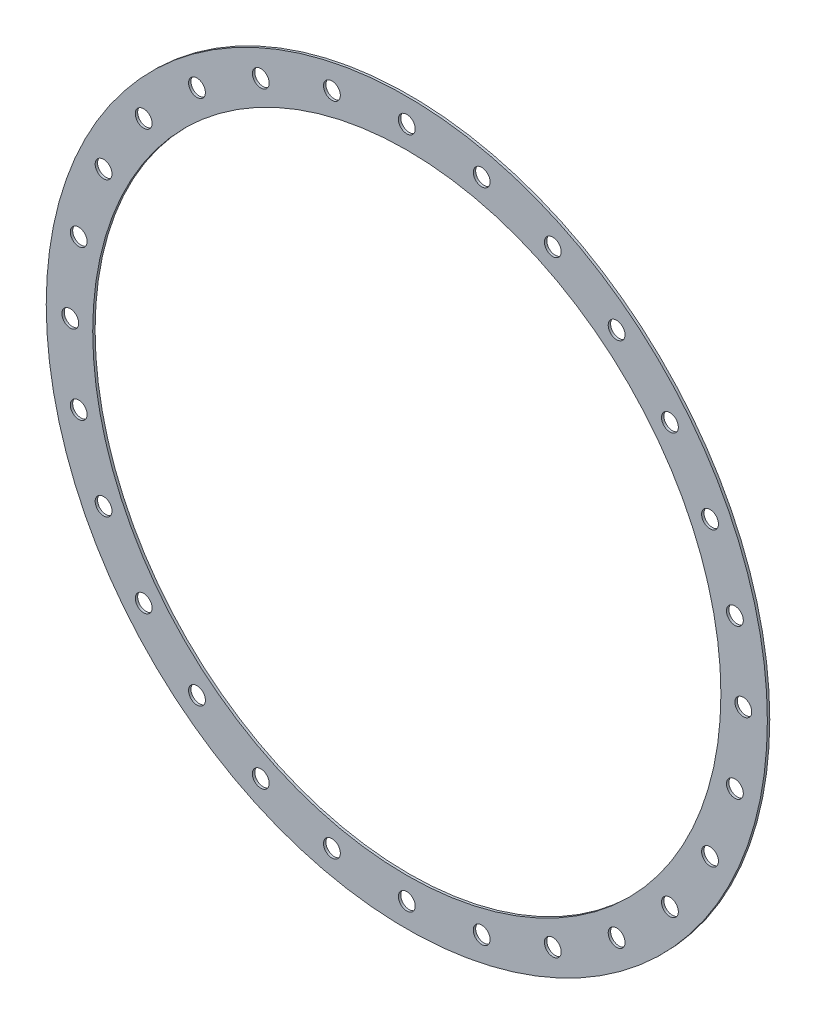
from build123d import *

# Parameters (mm, degrees)
CROQUIS1_R              = 225
CROQUIS1_R_2            = 196
SALIENTE_EXTRUIR1_DEPTH = 1.5
CROQUIS2_R              = 5.25
CORTAR_EXTRUIR1_DEPTH   = 1.5
MATRIZC1_COUNT          = 28


with BuildPart() as part:
    # Croquis1 → Saliente-Extruir1 (new body)
    with BuildSketch(Plane.XY):
        Circle(CROQUIS1_R)
        Circle(CROQUIS1_R_2, mode=Mode.SUBTRACT)
    extrude(amount=SALIENTE_EXTRUIR1_DEPTH)

    # Croquis2 → Cortar-Extruir1 (cut)
    with BuildSketch(Plane.XY.offset(1.5)):
        with Locations((0, 210)):
            Circle(CROQUIS2_R)
    cortar_extruir1 = extrude(amount=-CORTAR_EXTRUIR1_DEPTH, mode=Mode.SUBTRACT)

    # MatrizC1: Cortar-Extruir1 ×28 about axis
    matrizc1_axis = Axis((0, 0, 0), (0, 0, 1))
    for i in range(1, MATRIZC1_COUNT):
        add(cortar_extruir1.rotate(matrizc1_axis, i * 360 / MATRIZC1_COUNT), mode=Mode.SUBTRACT)


solid = part.part
